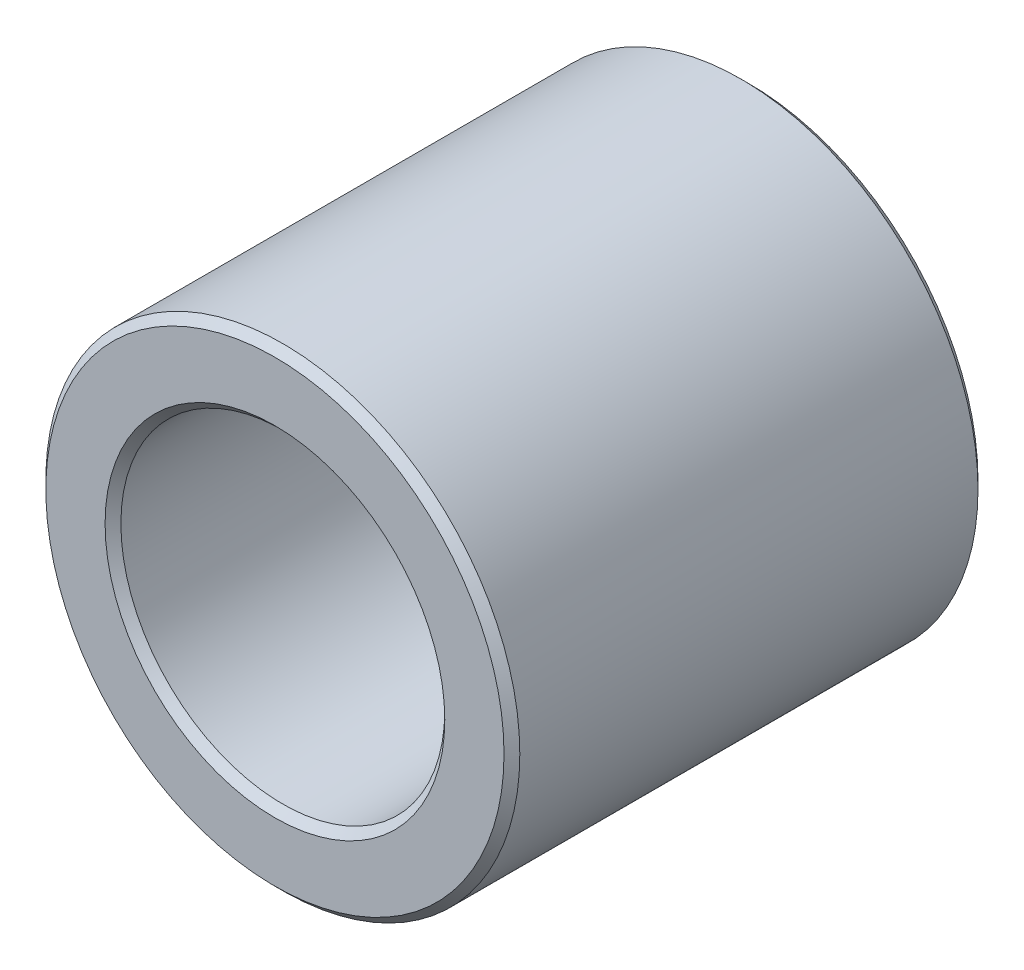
from build123d import *

# Parameters (mm, degrees)
SKETCH1_R           = 6
SKETCH1_R_2         = 4.1
BOSS_EXTRUDE2_DEPTH = 6
CHAMFER3_SIZE       = 0.2


with BuildPart() as part:
    # Sketch1 → Boss-Extrude2 (new, symmetric)
    with BuildSketch(Plane.XY):
        Circle(SKETCH1_R)
        Circle(SKETCH1_R_2, mode=Mode.SUBTRACT)
    extrude(amount=BOSS_EXTRUDE2_DEPTH, both=True)

    # Chamfer3
    chamfer3_edges = [part.edges().sort_by_distance(p)[0] for p in [
        (-6, 0, -6),
        (-6, 0, 6),
        (-4.1, 0, -6),
        (-4.1, 0, 6),
    ]]
    chamfer(chamfer3_edges, length=CHAMFER3_SIZE)


solid = part.part
